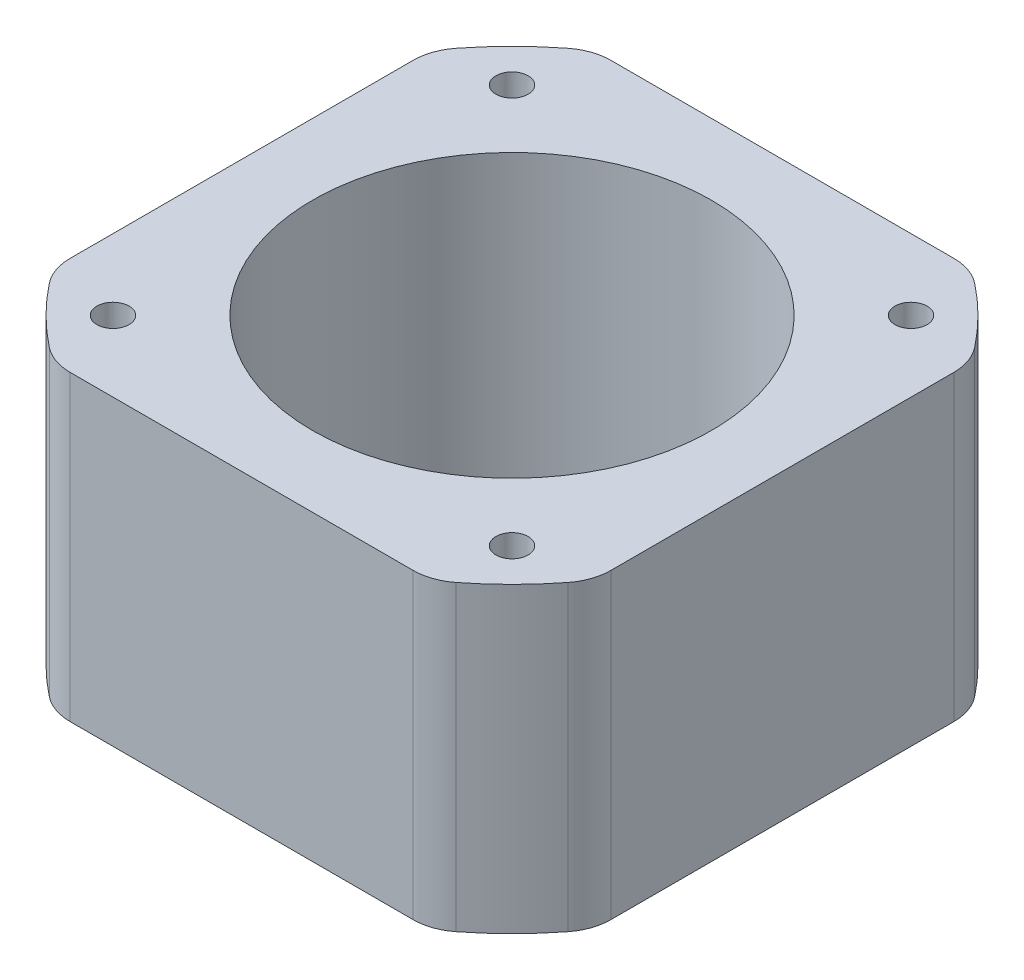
from build123d import *

# Parameters (mm, degrees)
SKETCH_1_R      = 1.25
SKETCH_1_R_2    = 15.5
EXTRUDE_1_DEPTH = 23.5
FILLET_1_R      = 4


with BuildPart() as part:
    # Sketch 1 → Extrude 1 (new body)
    with BuildSketch(Plane(origin=(0, 0, 0), x_dir=(1, 0, 0), z_dir=(0, 1, 0))):
        with BuildLine():
            Line((-14.641038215, -21), (14.641038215, -21))
            ThreePointArc((14.641038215, -21), (18.101933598, -18.101933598), (21, -14.641038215))
            Line((21, -14.641038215), (21, 14.641038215))
            ThreePointArc((21, 14.641038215), (18.101933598, 18.101933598), (14.641038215, 21))
            Line((14.641038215, 21), (-14.641038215, 21))
            ThreePointArc((-14.641038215, 21), (-18.101933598, 18.101933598), (-21, 14.641038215))
            Line((-21, 14.641038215), (-21, -14.641038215))
            ThreePointArc((-21, -14.641038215), (-18.101933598, -18.101933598), (-14.641038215, -21))
        make_face()
        with Locations(Location((-15.5, 15.5, 0), (0, 0, 270))):
            Circle(SKETCH_1_R, mode=Mode.SUBTRACT)
        with Locations(Location((15.5, 15.5, 0), (0, 0, 270))):
            Circle(SKETCH_1_R, mode=Mode.SUBTRACT)
        with Locations(Location((15.5, -15.5, 0), (0, 0, 270))):
            Circle(SKETCH_1_R, mode=Mode.SUBTRACT)
        with Locations(Location((-15.5, -15.5, 0), (0, 0, 270))):
            Circle(SKETCH_1_R, mode=Mode.SUBTRACT)
        with Locations(Location((0, 0, 0), (0, 0, 270))):
            Circle(SKETCH_1_R_2, mode=Mode.SUBTRACT)
    extrude(amount=EXTRUDE_1_DEPTH)

    # Fillet 1
    fillet_1_edges = [part.edges().sort_by_distance(p)[0] for p in [
        (21, 11.75, -14.641038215),
        (21, 11.75, 14.641038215),
        (14.641038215, 11.75, 21),
        (-14.641038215, 11.75, 21),
        (-21, 11.75, 14.641038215),
        (-21, 11.75, -14.641038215),
        (-14.641038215, 11.75, -21),
        (14.641038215, 11.75, -21),
    ]]
    fillet(fillet_1_edges, radius=FILLET_1_R)


solid = part.part
